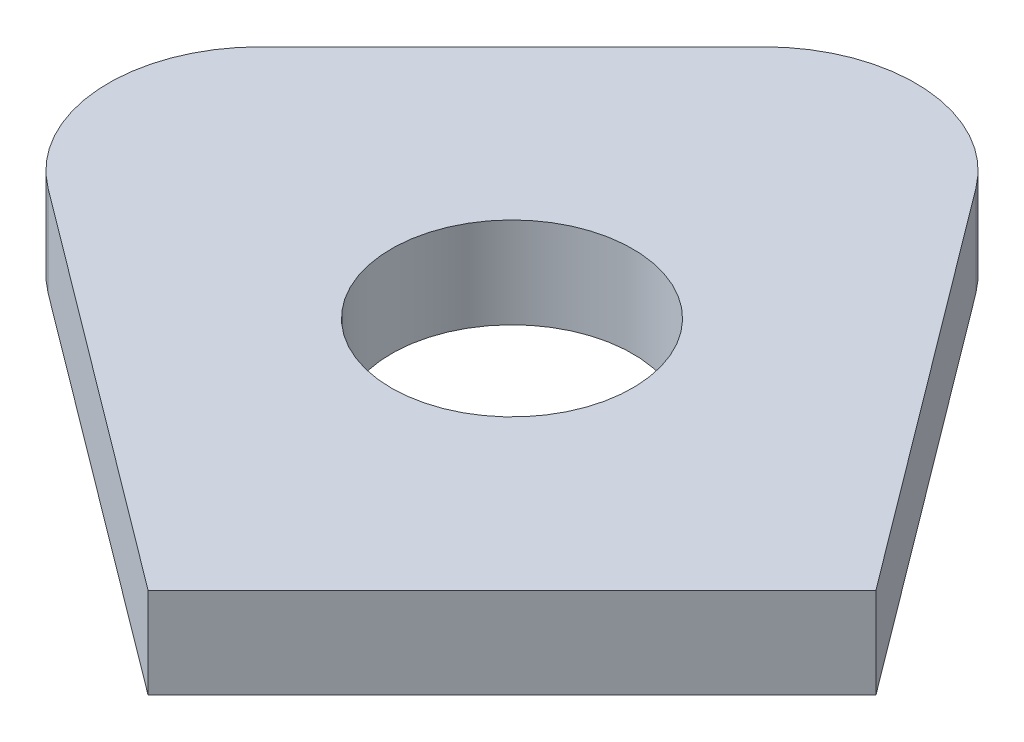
ISO-10303-21;
HEADER;
FILE_DESCRIPTION(('STEP AP214'),'2;1');
FILE_NAME('part.step','',(''),(''),'','','');
FILE_SCHEMA(('AUTOMOTIVE_DESIGN { 1 0 10303 214 1 1 1 1 }'));
ENDSEC;
DATA;
#1=APPLICATION_CONTEXT('core data for automotive mechanical design processes');
#2=APPLICATION_PROTOCOL_DEFINITION('international standard','automotive_design',2000,#1);
#3=PRODUCT_CONTEXT('',#1,'mechanical');
#4=PRODUCT('Part','Part','',(#3));
#5=PRODUCT_RELATED_PRODUCT_CATEGORY('part','',(#4));
#6=PRODUCT_DEFINITION_FORMATION('','',#4);
#7=PRODUCT_DEFINITION_CONTEXT('part definition',#1,'design');
#8=PRODUCT_DEFINITION('design','',#6,#7);
#9=PRODUCT_DEFINITION_SHAPE('','',#8);
#10=(LENGTH_UNIT() NAMED_UNIT(*) SI_UNIT(.MILLI.,.METRE.));
#11=(NAMED_UNIT(*) PLANE_ANGLE_UNIT() SI_UNIT($,.RADIAN.));
#12=(NAMED_UNIT(*) SI_UNIT($,.STERADIAN.) SOLID_ANGLE_UNIT());
#13=UNCERTAINTY_MEASURE_WITH_UNIT(LENGTH_MEASURE(1.E-05),#10,'distance_accuracy_value','');
#14=(GEOMETRIC_REPRESENTATION_CONTEXT(3) GLOBAL_UNCERTAINTY_ASSIGNED_CONTEXT((#13)) GLOBAL_UNIT_ASSIGNED_CONTEXT((#10,
#11,#12)) REPRESENTATION_CONTEXT('',''));
#15=CARTESIAN_POINT('',(0.,0.,0.));
#16=DIRECTION('',(0.,0.,1.));
#17=DIRECTION('',(1.,0.,0.));
#18=AXIS2_PLACEMENT_3D('',#15,#16,#17);
#19=CARTESIAN_POINT('',(47.5857046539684,70.,-23.0680101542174));
#20=DIRECTION('',(0.,1.,0.));
#21=DIRECTION('',(0.,0.,1.));
#22=AXIS2_PLACEMENT_3D('',#19,#20,#21);
#23=PLANE('',#22);
#24=DIRECTION('',(0.707106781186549,0.,-0.707106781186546));
#25=VECTOR('',#24,1.);
#26=CARTESIAN_POINT('',(51.2634559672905,70.,21.3050865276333));
#27=LINE('',#26,#25);
#28=CARTESIAN_POINT('',(51.2634559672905,70.,21.3050865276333));
#29=VERTEX_POINT('',#28);
#30=CARTESIAN_POINT('',(75.3050865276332,70.,-2.73654403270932));
#31=VERTEX_POINT('',#30);
#32=EDGE_CURVE('E128',#29,#31,#27,.T.);
#33=ORIENTED_EDGE('',*,*,#32,.T.);
#34=DIRECTION('',(-0.599431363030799,0.,-0.800426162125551));
#35=VECTOR('',#34,1.);
#36=CARTESIAN_POINT('',(75.3050865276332,70.,-2.73654403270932));
#37=LINE('',#36,#35);
#38=CARTESIAN_POINT('',(55.5899662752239,70.,-29.0623237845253));
#39=VERTEX_POINT('',#38);
#40=EDGE_CURVE('E86',#31,#39,#37,.T.);
#41=ORIENTED_EDGE('',*,*,#40,.T.);
#42=CARTESIAN_POINT('',(47.5857046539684,70.,-23.0680101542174));
#43=DIRECTION('',(0.,1.,0.));
#44=DIRECTION('',(0.,0.,1.));
#45=AXIS2_PLACEMENT_3D('',#42,#43,#44);
#46=CIRCLE('',#45,10.);
#47=CARTESIAN_POINT('',(40.5146368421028,70.,-30.1390779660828));
#48=VERTEX_POINT('',#47);
#49=EDGE_CURVE('E99',#39,#48,#46,.T.);
#50=ORIENTED_EDGE('',*,*,#49,.T.);
#51=DIRECTION('',(-0.707106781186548,0.,0.707106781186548));
#52=VECTOR('',#51,1.);
#53=CARTESIAN_POINT('',(40.5146368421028,70.,-30.1390779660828));
#54=LINE('',#53,#52);
#55=CARTESIAN_POINT('',(23.8609220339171,70.,-13.4853631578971));
#56=VERTEX_POINT('',#55);
#57=EDGE_CURVE('E93',#48,#56,#54,.T.);
#58=ORIENTED_EDGE('',*,*,#57,.T.);
#59=CARTESIAN_POINT('',(30.9319898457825,70.,-6.41429534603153));
#60=DIRECTION('',(0.,1.,0.));
#61=DIRECTION('',(0.,0.,1.));
#62=AXIS2_PLACEMENT_3D('',#59,#60,#61);
#63=CIRCLE('',#62,9.99999999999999);
#64=CARTESIAN_POINT('',(24.9376762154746,70.,1.58996627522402));
#65=VERTEX_POINT('',#64);
#66=EDGE_CURVE('E97',#56,#65,#63,.T.);
#67=ORIENTED_EDGE('',*,*,#66,.T.);
#68=DIRECTION('',(0.800426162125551,0.,0.599431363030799));
#69=VECTOR('',#68,1.);
#70=CARTESIAN_POINT('',(24.9376762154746,70.,1.58996627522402));
#71=LINE('',#70,#69);
#72=EDGE_CURVE('E49',#65,#29,#71,.T.);
#73=ORIENTED_EDGE('',*,*,#72,.T.);
#74=EDGE_LOOP('',(#33,#41,#50,#58,#67,#73));
#75=FACE_BOUND('',#74,.T.);
#76=CARTESIAN_POINT('',(47.7279220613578,70.,-6.27207793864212));
#77=DIRECTION('',(0.,1.,0.));
#78=DIRECTION('',(0.,0.,1.));
#79=AXIS2_PLACEMENT_3D('',#76,#77,#78);
#80=CIRCLE('',#79,7.96999999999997);
#81=CARTESIAN_POINT('',(47.7279220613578,70.,1.69792206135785));
#82=VERTEX_POINT('',#81);
#83=EDGE_CURVE('E121',#82,#82,#80,.T.);
#84=ORIENTED_EDGE('',*,*,#83,.F.);
#85=EDGE_LOOP('',(#84));
#86=FACE_BOUND('',#85,.T.);
#87=ADVANCED_FACE('F32',(#75,#86),#23,.T.);
#88=CARTESIAN_POINT('',(47.5857046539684,64.,-23.0680101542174));
#89=DIRECTION('',(0.,1.,0.));
#90=DIRECTION('',(0.,0.,1.));
#91=AXIS2_PLACEMENT_3D('',#88,#89,#90);
#92=PLANE('',#91);
#93=DIRECTION('',(0.707106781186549,0.,-0.707106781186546));
#94=VECTOR('',#93,1.);
#95=CARTESIAN_POINT('',(51.2634559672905,64.,21.3050865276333));
#96=LINE('',#95,#94);
#97=CARTESIAN_POINT('',(51.2634559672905,64.,21.3050865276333));
#98=VERTEX_POINT('',#97);
#99=CARTESIAN_POINT('',(75.3050865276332,64.,-2.73654403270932));
#100=VERTEX_POINT('',#99);
#101=EDGE_CURVE('E117',#98,#100,#96,.T.);
#102=ORIENTED_EDGE('',*,*,#101,.F.);
#103=DIRECTION('',(0.800426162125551,0.,0.599431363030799));
#104=VECTOR('',#103,1.);
#105=CARTESIAN_POINT('',(24.9376762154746,64.,1.58996627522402));
#106=LINE('',#105,#104);
#107=CARTESIAN_POINT('',(24.9376762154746,64.,1.58996627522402));
#108=VERTEX_POINT('',#107);
#109=EDGE_CURVE('E78',#108,#98,#106,.T.);
#110=ORIENTED_EDGE('',*,*,#109,.F.);
#111=CARTESIAN_POINT('',(30.9319898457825,64.,-6.41429534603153));
#112=DIRECTION('',(0.,1.,0.));
#113=DIRECTION('',(0.,0.,1.));
#114=AXIS2_PLACEMENT_3D('',#111,#112,#113);
#115=CIRCLE('',#114,9.99999999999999);
#116=CARTESIAN_POINT('',(23.8609220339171,64.,-13.4853631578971));
#117=VERTEX_POINT('',#116);
#118=EDGE_CURVE('E72',#117,#108,#115,.T.);
#119=ORIENTED_EDGE('',*,*,#118,.F.);
#120=DIRECTION('',(-0.707106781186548,0.,0.707106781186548));
#121=VECTOR('',#120,1.);
#122=CARTESIAN_POINT('',(40.5146368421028,64.,-30.1390779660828));
#123=LINE('',#122,#121);
#124=CARTESIAN_POINT('',(40.5146368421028,64.,-30.1390779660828));
#125=VERTEX_POINT('',#124);
#126=EDGE_CURVE('E107',#125,#117,#123,.T.);
#127=ORIENTED_EDGE('',*,*,#126,.F.);
#128=CARTESIAN_POINT('',(47.5857046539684,64.,-23.0680101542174));
#129=DIRECTION('',(0.,1.,0.));
#130=DIRECTION('',(0.,0.,1.));
#131=AXIS2_PLACEMENT_3D('',#128,#129,#130);
#132=CIRCLE('',#131,10.);
#133=CARTESIAN_POINT('',(55.5899662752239,64.,-29.0623237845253));
#134=VERTEX_POINT('',#133);
#135=EDGE_CURVE('E123',#134,#125,#132,.T.);
#136=ORIENTED_EDGE('',*,*,#135,.F.);
#137=DIRECTION('',(-0.599431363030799,0.,-0.800426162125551));
#138=VECTOR('',#137,1.);
#139=CARTESIAN_POINT('',(75.3050865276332,64.,-2.73654403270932));
#140=LINE('',#139,#138);
#141=EDGE_CURVE('E120',#100,#134,#140,.T.);
#142=ORIENTED_EDGE('',*,*,#141,.F.);
#143=EDGE_LOOP('',(#102,#110,#119,#127,#136,#142));
#144=FACE_BOUND('',#143,.T.);
#145=CARTESIAN_POINT('',(47.7279220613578,64.,-6.27207793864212));
#146=DIRECTION('',(0.,1.,0.));
#147=DIRECTION('',(0.,0.,1.));
#148=AXIS2_PLACEMENT_3D('',#145,#146,#147);
#149=CIRCLE('',#148,7.96999999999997);
#150=CARTESIAN_POINT('',(47.7279220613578,64.,1.69792206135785));
#151=VERTEX_POINT('',#150);
#152=EDGE_CURVE('E221',#151,#151,#149,.T.);
#153=ORIENTED_EDGE('',*,*,#152,.T.);
#154=EDGE_LOOP('',(#153));
#155=FACE_BOUND('',#154,.T.);
#156=ADVANCED_FACE('F137',(#144,#155),#92,.F.);
#157=CARTESIAN_POINT('',(51.2634559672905,70.,21.3050865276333));
#158=DIRECTION('',(-0.707106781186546,0.,-0.707106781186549));
#159=DIRECTION('',(-0.707106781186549,0.,0.707106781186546));
#160=AXIS2_PLACEMENT_3D('',#157,#158,#159);
#161=PLANE('',#160);
#162=ORIENTED_EDGE('',*,*,#101,.T.);
#163=DIRECTION('',(0.,-1.,0.));
#164=VECTOR('',#163,1.);
#165=CARTESIAN_POINT('',(75.3050865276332,70.,-2.73654403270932));
#166=LINE('',#165,#164);
#167=EDGE_CURVE('E11',#31,#100,#166,.T.);
#168=ORIENTED_EDGE('',*,*,#167,.F.);
#169=ORIENTED_EDGE('',*,*,#32,.F.);
#170=DIRECTION('',(0.,-1.,0.));
#171=VECTOR('',#170,1.);
#172=CARTESIAN_POINT('',(51.2634559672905,70.,21.3050865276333));
#173=LINE('',#172,#171);
#174=EDGE_CURVE('E113',#29,#98,#173,.T.);
#175=ORIENTED_EDGE('',*,*,#174,.T.);
#176=EDGE_LOOP('',(#162,#168,#169,#175));
#177=FACE_BOUND('',#176,.T.);
#178=ADVANCED_FACE('F34',(#177),#161,.F.);
#179=CARTESIAN_POINT('',(75.3050865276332,70.,-2.73654403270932));
#180=DIRECTION('',(-0.800426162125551,0.,0.599431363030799));
#181=DIRECTION('',(0.599431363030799,0.,0.800426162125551));
#182=AXIS2_PLACEMENT_3D('',#179,#180,#181);
#183=PLANE('',#182);
#184=ORIENTED_EDGE('',*,*,#141,.T.);
#185=DIRECTION('',(0.,-1.,0.));
#186=VECTOR('',#185,1.);
#187=CARTESIAN_POINT('',(55.5899662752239,70.,-29.0623237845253));
#188=LINE('',#187,#186);
#189=EDGE_CURVE('E41',#39,#134,#188,.T.);
#190=ORIENTED_EDGE('',*,*,#189,.F.);
#191=ORIENTED_EDGE('',*,*,#40,.F.);
#192=ORIENTED_EDGE('',*,*,#167,.T.);
#193=EDGE_LOOP('',(#184,#190,#191,#192));
#194=FACE_BOUND('',#193,.T.);
#195=ADVANCED_FACE('F162',(#194),#183,.F.);
#196=CARTESIAN_POINT('',(47.5857046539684,70.,-23.0680101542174));
#197=DIRECTION('',(0.,-1.,0.));
#198=DIRECTION('',(0.,0.,-1.));
#199=AXIS2_PLACEMENT_3D('',#196,#197,#198);
#200=CYLINDRICAL_SURFACE('',#199,10.);
#201=ORIENTED_EDGE('',*,*,#135,.T.);
#202=DIRECTION('',(0.,-1.,0.));
#203=VECTOR('',#202,1.);
#204=CARTESIAN_POINT('',(40.5146368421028,70.,-30.1390779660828));
#205=LINE('',#204,#203);
#206=EDGE_CURVE('E108',#48,#125,#205,.T.);
#207=ORIENTED_EDGE('',*,*,#206,.F.);
#208=ORIENTED_EDGE('',*,*,#49,.F.);
#209=ORIENTED_EDGE('',*,*,#189,.T.);
#210=EDGE_LOOP('',(#201,#207,#208,#209));
#211=FACE_BOUND('',#210,.T.);
#212=ADVANCED_FACE('F134',(#211),#200,.T.);
#213=CARTESIAN_POINT('',(40.5146368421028,70.,-30.1390779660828));
#214=DIRECTION('',(0.707106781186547,0.,0.707106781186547));
#215=DIRECTION('',(0.707106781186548,0.,-0.707106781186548));
#216=AXIS2_PLACEMENT_3D('',#213,#214,#215);
#217=PLANE('',#216);
#218=ORIENTED_EDGE('',*,*,#126,.T.);
#219=DIRECTION('',(0.,-1.,0.));
#220=VECTOR('',#219,1.);
#221=CARTESIAN_POINT('',(23.8609220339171,70.,-13.4853631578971));
#222=LINE('',#221,#220);
#223=EDGE_CURVE('E104',#56,#117,#222,.T.);
#224=ORIENTED_EDGE('',*,*,#223,.F.);
#225=ORIENTED_EDGE('',*,*,#57,.F.);
#226=ORIENTED_EDGE('',*,*,#206,.T.);
#227=EDGE_LOOP('',(#218,#224,#225,#226));
#228=FACE_BOUND('',#227,.T.);
#229=ADVANCED_FACE('F105',(#228),#217,.F.);
#230=CARTESIAN_POINT('',(30.9319898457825,70.,-6.41429534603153));
#231=DIRECTION('',(0.,-1.,0.));
#232=DIRECTION('',(0.,0.,-1.));
#233=AXIS2_PLACEMENT_3D('',#230,#231,#232);
#234=CYLINDRICAL_SURFACE('',#233,9.99999999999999);
#235=ORIENTED_EDGE('',*,*,#118,.T.);
#236=DIRECTION('',(0.,-1.,0.));
#237=VECTOR('',#236,1.);
#238=CARTESIAN_POINT('',(24.9376762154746,70.,1.58996627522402));
#239=LINE('',#238,#237);
#240=EDGE_CURVE('E109',#65,#108,#239,.T.);
#241=ORIENTED_EDGE('',*,*,#240,.F.);
#242=ORIENTED_EDGE('',*,*,#66,.F.);
#243=ORIENTED_EDGE('',*,*,#223,.T.);
#244=EDGE_LOOP('',(#235,#241,#242,#243));
#245=FACE_BOUND('',#244,.T.);
#246=ADVANCED_FACE('F111',(#245),#234,.T.);
#247=CARTESIAN_POINT('',(24.9376762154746,70.,1.58996627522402));
#248=DIRECTION('',(0.599431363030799,0.,-0.800426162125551));
#249=DIRECTION('',(-0.800426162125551,0.,-0.599431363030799));
#250=AXIS2_PLACEMENT_3D('',#247,#248,#249);
#251=PLANE('',#250);
#252=ORIENTED_EDGE('',*,*,#109,.T.);
#253=ORIENTED_EDGE('',*,*,#174,.F.);
#254=ORIENTED_EDGE('',*,*,#72,.F.);
#255=ORIENTED_EDGE('',*,*,#240,.T.);
#256=EDGE_LOOP('',(#252,#253,#254,#255));
#257=FACE_BOUND('',#256,.T.);
#258=ADVANCED_FACE('F142',(#257),#251,.F.);
#259=CARTESIAN_POINT('',(47.7279220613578,70.,-6.27207793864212));
#260=DIRECTION('',(0.,-1.,0.));
#261=DIRECTION('',(0.,0.,-1.));
#262=AXIS2_PLACEMENT_3D('',#259,#260,#261);
#263=CYLINDRICAL_SURFACE('',#262,7.96999999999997);
#264=ORIENTED_EDGE('',*,*,#83,.T.);
#265=EDGE_LOOP('',(#264));
#266=FACE_BOUND('',#265,.T.);
#267=ORIENTED_EDGE('',*,*,#152,.F.);
#268=EDGE_LOOP('',(#267));
#269=FACE_BOUND('',#268,.T.);
#270=ADVANCED_FACE('F144',(#266,#269),#263,.F.);
#271=CLOSED_SHELL('',(#87,#156,#178,#195,#212,#229,#246,#258,#270));
#272=MANIFOLD_SOLID_BREP('B2',#271);
#273=ADVANCED_BREP_SHAPE_REPRESENTATION('',(#18,#272),#14);
#274=SHAPE_DEFINITION_REPRESENTATION(#9,#273);
ENDSEC;
END-ISO-10303-21;
